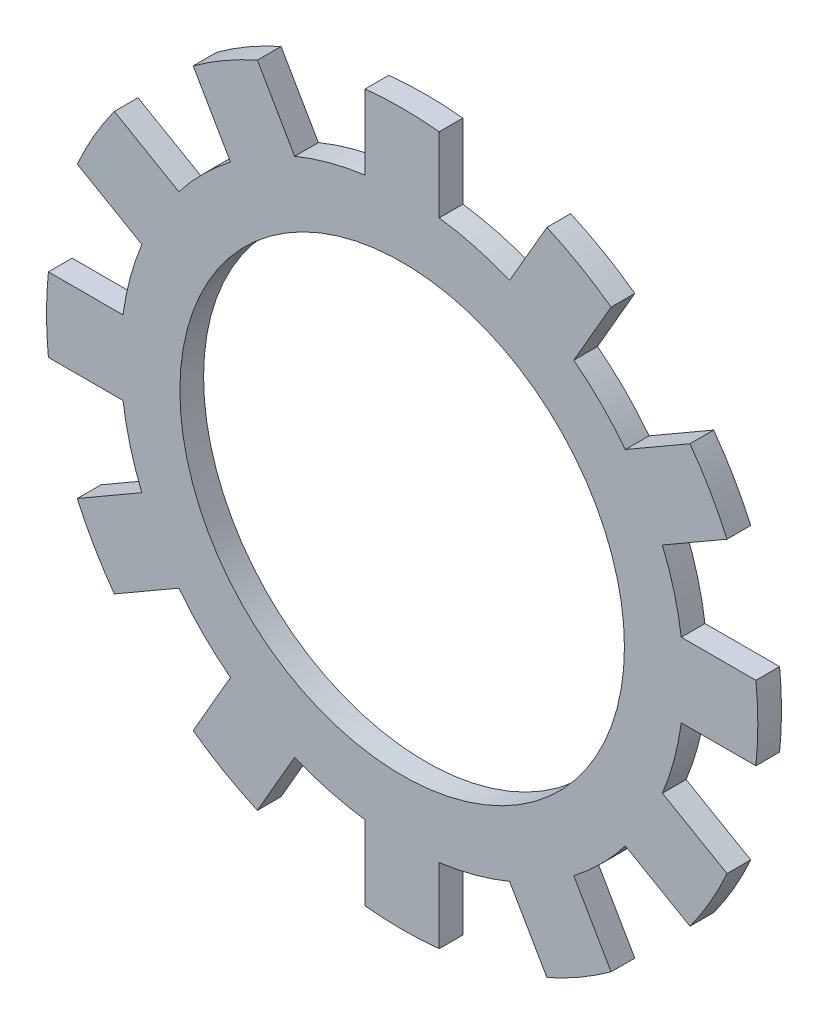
from build123d import *

# Parameters (mm, degrees)
SKETCH1_R                 = 19
SKETCH1_R_2               = 15
BOSS_EXTRUDE1_DEPTH       = 0.8
BOSS_EXTRUDE2_DEPTH       = 0.8
CIRPATTERN2_COUNT         = 12
CIRPATTERN2_COPY_1_DEPTH  = 0.8
CIRPATTERN2_COPY_2_DEPTH  = 0.8
CIRPATTERN2_COPY_3_DEPTH  = 0.8
CIRPATTERN2_COPY_4_DEPTH  = 0.8
CIRPATTERN2_COPY_5_DEPTH  = 0.8
CIRPATTERN2_COPY_6_DEPTH  = 0.8
CIRPATTERN2_COPY_7_DEPTH  = 0.8
CIRPATTERN2_COPY_8_DEPTH  = 0.8
CIRPATTERN2_COPY_9_DEPTH  = 0.8
CIRPATTERN2_COPY_10_DEPTH = 0.8
CIRPATTERN2_COPY_11_DEPTH = 0.8


with BuildPart() as part:
    # Sketch1 → Boss-Extrude1 (new, symmetric)
    with BuildSketch(Plane.XY):
        Circle(SKETCH1_R)
        Circle(SKETCH1_R_2, mode=Mode.SUBTRACT)
    extrude(amount=BOSS_EXTRUDE1_DEPTH, both=True)

    # Sketch3 → Boss-Extrude2 (add, symmetric)
    with BuildSketch(Plane.XY):
        with BuildLine():
            Line((-2.5, 23.869436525), (-2.5, 18.834808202))
            ThreePointArc((-2.5, 18.834808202), (-1.252725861, 18.958657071), (0, 19))
            Line((0, 19), (0, 24))
            ThreePointArc((0, 24), (-1.251703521, 23.967336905), (-2.5, 23.869436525))
        make_face()
    boss_extrude2 = extrude(amount=BOSS_EXTRUDE2_DEPTH, both=True)

    # Mirror1: Boss-Extrude2 across plane
    add(boss_extrude2.mirror(Plane(origin=(0, 0, 0), x_dir=(0, 0, 1), z_dir=(1, 0, 0))))

    # CirPattern2: Boss-Extrude2 ×12 about axis
    cirpattern2_axis = Axis((0, 0, 0), (0, 0, 1))
    for i in range(1, CIRPATTERN2_COUNT):
        add(boss_extrude2.rotate(cirpattern2_axis, i * 360 / CIRPATTERN2_COUNT))

    # CirPattern2 copy 1 sketch → CirPattern2 copy 1 (add, symmetric)
    with BuildSketch(Plane(origin=(0, 0, 0), x_dir=(-0.8660254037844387, -0.49999999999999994, 0), z_dir=(0, 0, 1))):
        with BuildLine():
            Line((-2.5, -23.869436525), (-2.5, -18.834808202))
            ThreePointArc((-2.5, -18.834808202), (-1.252725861, -18.958657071), (0, -19))
            Line((0, -19), (0, -24))
            ThreePointArc((0, -24), (-1.251703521, -23.967336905), (-2.5, -23.869436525))
        make_face()
    extrude(amount=CIRPATTERN2_COPY_1_DEPTH, both=True)

    # CirPattern2 copy 2 sketch → CirPattern2 copy 2 (add, symmetric)
    with BuildSketch(Plane(origin=(0, 0, 0), x_dir=(-0.5000000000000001, -0.8660254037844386, 0), z_dir=(0, 0, 1))):
        with BuildLine():
            Line((-2.5, -23.869436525), (-2.5, -18.834808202))
            ThreePointArc((-2.5, -18.834808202), (-1.252725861, -18.958657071), (0, -19))
            Line((0, -19), (0, -24))
            ThreePointArc((0, -24), (-1.251703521, -23.967336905), (-2.5, -23.869436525))
        make_face()
    extrude(amount=CIRPATTERN2_COPY_2_DEPTH, both=True)

    # CirPattern2 copy 3 sketch → CirPattern2 copy 3 (add, symmetric)
    with BuildSketch(Plane(origin=(0, 0, 0), x_dir=(0, -1, 0), z_dir=(0, 0, 1))):
        with BuildLine():
            Line((-2.5, -23.869436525), (-2.5, -18.834808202))
            ThreePointArc((-2.5, -18.834808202), (-1.252725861, -18.958657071), (0, -19))
            Line((0, -19), (0, -24))
            ThreePointArc((0, -24), (-1.251703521, -23.967336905), (-2.5, -23.869436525))
        make_face()
    extrude(amount=CIRPATTERN2_COPY_3_DEPTH, both=True)

    # CirPattern2 copy 4 sketch → CirPattern2 copy 4 (add, symmetric)
    with BuildSketch(Plane(origin=(0, 0, 0), x_dir=(0.4999999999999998, -0.8660254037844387, 0), z_dir=(0, 0, 1))):
        with BuildLine():
            Line((-2.5, -23.869436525), (-2.5, -18.834808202))
            ThreePointArc((-2.5, -18.834808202), (-1.252725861, -18.958657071), (0, -19))
            Line((0, -19), (0, -24))
            ThreePointArc((0, -24), (-1.251703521, -23.967336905), (-2.5, -23.869436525))
        make_face()
    extrude(amount=CIRPATTERN2_COPY_4_DEPTH, both=True)

    # CirPattern2 copy 5 sketch → CirPattern2 copy 5 (add, symmetric)
    with BuildSketch(Plane(origin=(0, 0, 0), x_dir=(0.8660254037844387, -0.49999999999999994, 0), z_dir=(0, 0, 1))):
        with BuildLine():
            Line((-2.5, -23.869436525), (-2.5, -18.834808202))
            ThreePointArc((-2.5, -18.834808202), (-1.252725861, -18.958657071), (0, -19))
            Line((0, -19), (0, -24))
            ThreePointArc((0, -24), (-1.251703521, -23.967336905), (-2.5, -23.869436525))
        make_face()
    extrude(amount=CIRPATTERN2_COPY_5_DEPTH, both=True)

    # CirPattern2 copy 6 sketch → CirPattern2 copy 6 (add, symmetric)
    with BuildSketch(Plane.XY):
        with BuildLine():
            Line((-2.5, -23.869436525), (-2.5, -18.834808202))
            ThreePointArc((-2.5, -18.834808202), (-1.252725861, -18.958657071), (0, -19))
            Line((0, -19), (0, -24))
            ThreePointArc((0, -24), (-1.251703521, -23.967336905), (-2.5, -23.869436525))
        make_face()
    extrude(amount=CIRPATTERN2_COPY_6_DEPTH, both=True)

    # CirPattern2 copy 7 sketch → CirPattern2 copy 7 (add, symmetric)
    with BuildSketch(Plane(origin=(0, 0, 0), x_dir=(0.8660254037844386, 0.5000000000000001, 0), z_dir=(0, 0, 1))):
        with BuildLine():
            Line((-2.5, -23.869436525), (-2.5, -18.834808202))
            ThreePointArc((-2.5, -18.834808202), (-1.252725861, -18.958657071), (0, -19))
            Line((0, -19), (0, -24))
            ThreePointArc((0, -24), (-1.251703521, -23.967336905), (-2.5, -23.869436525))
        make_face()
    extrude(amount=CIRPATTERN2_COPY_7_DEPTH, both=True)

    # CirPattern2 copy 8 sketch → CirPattern2 copy 8 (add, symmetric)
    with BuildSketch(Plane(origin=(0, 0, 0), x_dir=(0.5000000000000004, 0.8660254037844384, 0), z_dir=(0, 0, 1))):
        with BuildLine():
            Line((-2.5, -23.869436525), (-2.5, -18.834808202))
            ThreePointArc((-2.5, -18.834808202), (-1.252725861, -18.958657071), (0, -19))
            Line((0, -19), (0, -24))
            ThreePointArc((0, -24), (-1.251703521, -23.967336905), (-2.5, -23.869436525))
        make_face()
    extrude(amount=CIRPATTERN2_COPY_8_DEPTH, both=True)

    # CirPattern2 copy 9 sketch → CirPattern2 copy 9 (add, symmetric)
    with BuildSketch(Plane(origin=(0, 0, 0), x_dir=(0, 1, 0), z_dir=(0, 0, 1))):
        with BuildLine():
            Line((-2.5, -23.869436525), (-2.5, -18.834808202))
            ThreePointArc((-2.5, -18.834808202), (-1.252725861, -18.958657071), (0, -19))
            Line((0, -19), (0, -24))
            ThreePointArc((0, -24), (-1.251703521, -23.967336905), (-2.5, -23.869436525))
        make_face()
    extrude(amount=CIRPATTERN2_COPY_9_DEPTH, both=True)

    # CirPattern2 copy 10 sketch → CirPattern2 copy 10 (add, symmetric)
    with BuildSketch(Plane(origin=(0, 0, 0), x_dir=(-0.5000000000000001, 0.8660254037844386, 0), z_dir=(0, 0, 1))):
        with BuildLine():
            Line((-2.5, -23.869436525), (-2.5, -18.834808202))
            ThreePointArc((-2.5, -18.834808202), (-1.252725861, -18.958657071), (0, -19))
            Line((0, -19), (0, -24))
            ThreePointArc((0, -24), (-1.251703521, -23.967336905), (-2.5, -23.869436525))
        make_face()
    extrude(amount=CIRPATTERN2_COPY_10_DEPTH, both=True)

    # CirPattern2 copy 11 sketch → CirPattern2 copy 11 (add, symmetric)
    with BuildSketch(Plane(origin=(0, 0, 0), x_dir=(-0.8660254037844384, 0.5000000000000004, 0), z_dir=(0, 0, 1))):
        with BuildLine():
            Line((-2.5, -23.869436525), (-2.5, -18.834808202))
            ThreePointArc((-2.5, -18.834808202), (-1.252725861, -18.958657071), (0, -19))
            Line((0, -19), (0, -24))
            ThreePointArc((0, -24), (-1.251703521, -23.967336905), (-2.5, -23.869436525))
        make_face()
    extrude(amount=CIRPATTERN2_COPY_11_DEPTH, both=True)


solid = part.part
